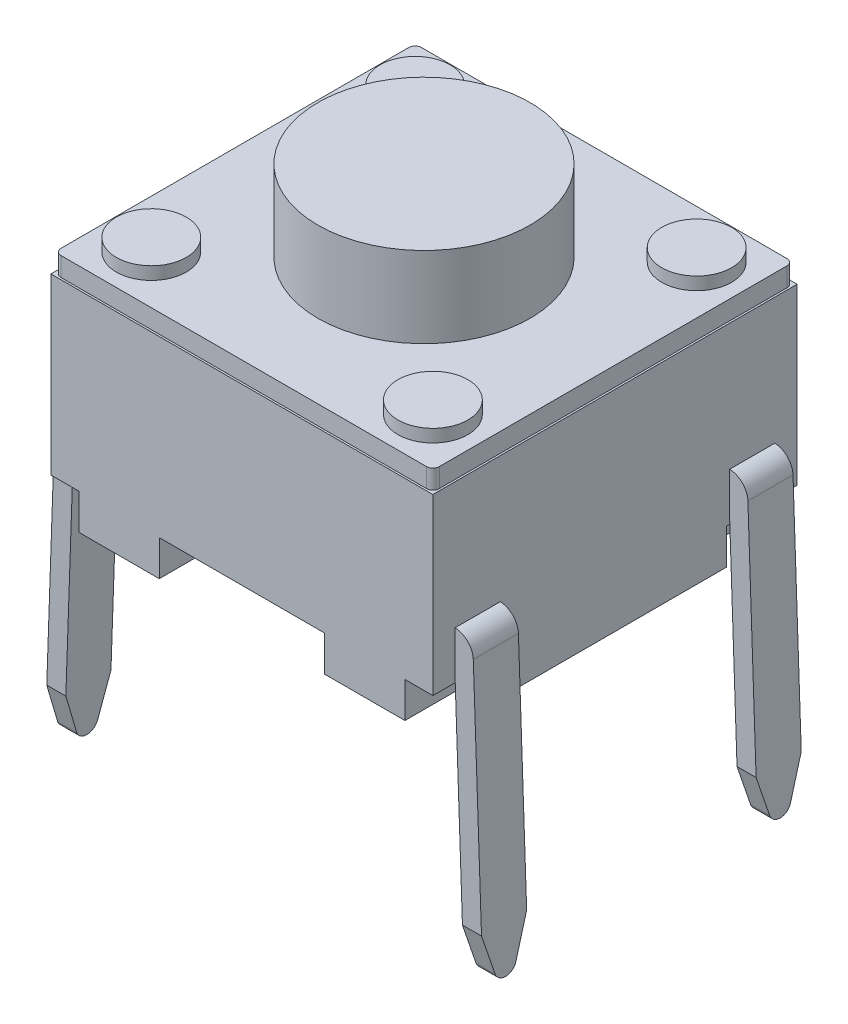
from build123d import *

# Parameters (mm, degrees)
ESQUISSE1_W                  = 6.01
ESQUISSE1_H                  = 5.03
EXTRUSION1_DEPTH             = 0.71
EXTRUSION2_DEPTH             = 0.71
CONG_1_R                     = 0.3
ENL_V_MAT_EXTRU_1_DEPTH      = 10.105035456
ENL_V_MAT_EXTRU_1_DEPTH_BACK = 10.105035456
EXTRUSION3_DEPTH             = 0.6
EXTRUSION4_DEPTH             = 2.865
EXTRUSION4_DEPTH_BACK        = 2.865
ESQUISSE7_W                  = 6.01
ESQUISSE7_H                  = 1.31
ESQUISSE9_W                  = 6.01
ESQUISSE9_H                  = 5.73
EXTRUSION6_DEPTH             = 3.3
ESQUISSE10_W                 = 2.6
ESQUISSE10_H                 = 0.56
ENL_V_MAT_EXTRU_2_DEPTH      = 10.509661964
ESQUISSE11_W                 = 1.14
ESQUISSE11_H                 = 1.12
ENL_V_MAT_EXTRU_3_DEPTH      = 0.56
ESQUISSE12_W                 = 0.44
ESQUISSE12_H                 = 1.11
ENL_V_MAT_EXTRU_4_DEPTH      = 0.56
ESQUISSE13_W                 = 5.95
ESQUISSE13_H                 = 5.67
EXTRUSION7_DEPTH             = 0.3
ESQUISSE14_R                 = 1.67
EXTRUSION8_DEPTH             = 1.27
ESQUISSE15_R                 = 0.55
EXTRUSION9_DEPTH             = 0.2
CONG_2_R                     = 0.1


with BuildPart() as part:
    # Esquisse1 → Extrusion1 (new body)
    with BuildSketch(Plane(origin=(0, 0, 0), x_dir=(1, 0, 0), z_dir=(0, 1, 0))):
        with Locations((3.005, 2.515)):
            Rectangle(ESQUISSE1_W, ESQUISSE1_H)
    extrude(amount=EXTRUSION1_DEPTH)

    # Esquisse3 → Extrusion2 (add)
    with BuildSketch(Plane.XY):
        Polygon((5.985206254, 0.71), (6.149683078, -4), (6.449865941, -4), (6.285389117, 0.71), align=None)
        Polygon((-0.139683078, -4), (-0.439865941, -4), (-0.275389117, 0.71), (0.024793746, 0.71), align=None)
    extrusion2 = extrude(amount=-EXTRUSION2_DEPTH)

    # Sym_trie1: Extrusion2 across plane
    add(extrusion2.mirror(Plane.XY.offset(-2.515)))

    # Cong_1
    cong_1_edges = [part.edges().sort_by_distance(p)[0] for p in [
        (6.285389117, 0.71, -0.355),
        (-0.275389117, 0.71, -0.355),
    ]]
    fillet(cong_1_edges, radius=CONG_1_R)

    # Esquisse5 → Enl_v. mat.-Extru.1 (cut, two sides: drawn at the far end of the back side and taken through both)
    with BuildSketch(Plane(origin=(0, 0, 0), x_dir=(0, 0, -1), z_dir=(1, 0, 0)).offset(-ENL_V_MAT_EXTRU_1_DEPTH_BACK)):
        with BuildLine():
            Line((0.714694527, -3.27), (0.516394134, -3.891715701))
            ThreePointArc((0.516394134, -3.891715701), (0.355, -4), (0.193605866, -3.891715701))
            Line((0.193605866, -3.891715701), (-0.004694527, -3.27))
            Line((-0.004694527, -3.27), (-0.420575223, -3.27))
            Line((-0.420575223, -3.27), (-0.420575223, -4.427126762))
            Line((-0.420575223, -4.427126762), (0.992315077, -4.427126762))
            Line((0.992315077, -4.427126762), (0.992315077, -3.27))
            Line((0.992315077, -3.27), (0.714694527, -3.27))
        make_face()
        with BuildLine():
            Line((4.037684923, -3.27), (4.315305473, -3.27))
            Line((4.315305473, -3.27), (4.513605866, -3.891715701))
            ThreePointArc((4.513605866, -3.891715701), (4.675, -4), (4.836394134, -3.891715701))
            Line((4.836394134, -3.891715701), (5.034694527, -3.27))
            Line((5.034694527, -3.27), (5.450575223, -3.27))
            Line((5.450575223, -3.27), (5.450575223, -4.427126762))
            Line((5.450575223, -4.427126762), (4.037684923, -4.427126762))
            Line((4.037684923, -4.427126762), (4.037684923, -3.27))
        make_face()
    extrude(amount=ENL_V_MAT_EXTRU_1_DEPTH + ENL_V_MAT_EXTRU_1_DEPTH_BACK, mode=Mode.SUBTRACT)

    # Esquisse6 → Extrusion3 (add)
    with BuildSketch(Plane.XZ):
        Polygon((0, -4.32), (0, -5.03), (6.01, -5.03), (6.01, -4.32), (6.01, -0.71), (6.01, 0), (0, 0), (0, -0.71), align=None)
    extrude(amount=EXTRUSION3_DEPTH)

    # Esquisse7 → Extrusion4 (add, two sides: drawn at the far end of the back side and taken through both)
    with BuildSketch(Plane(origin=(0, 0, -2.515), x_dir=(-1, 0, 0), z_dir=(0, 0, -1)).offset(-EXTRUSION4_DEPTH_BACK)):
        with Locations((-3.005, 0.055)):
            Rectangle(ESQUISSE7_W, ESQUISSE7_H)
    extrude(amount=EXTRUSION4_DEPTH + EXTRUSION4_DEPTH_BACK)

    # Esquisse9 → Extrusion6 (add)
    with BuildSketch(Plane(origin=(0, -0.6, 0), x_dir=(-1, 0, 0), z_dir=(0, 1, 0))):
        with Locations((-3.005, -2.515)):
            Rectangle(ESQUISSE9_W, ESQUISSE9_H)
    extrude(amount=EXTRUSION6_DEPTH)

    # Esquisse10 → Enl_v. mat.-Extru.2 (cut, through all)
    with BuildSketch(Plane(origin=(0, 0, -5.38), x_dir=(-1, 0, 0), z_dir=(0, 0, -1))):
        with Locations((-3.005, -0.32)):
            Rectangle(ESQUISSE10_W, ESQUISSE10_H)
    extrude(amount=-ENL_V_MAT_EXTRU_2_DEPTH, mode=Mode.SUBTRACT)

    # Esquisse11 → Enl_v. mat.-Extru.3 (cut)
    with BuildSketch(Plane.XZ.offset(0.6)):
        with Locations((1.135, -2.515)):
            Rectangle(ESQUISSE11_W, ESQUISSE11_H)
        with Locations((4.875, -2.515)):
            Rectangle(ESQUISSE11_W, ESQUISSE11_H)
    extrude(amount=-ENL_V_MAT_EXTRU_3_DEPTH, mode=Mode.SUBTRACT)

    # Esquisse12 → Enl_v. mat.-Extru.4 (cut)
    with BuildSketch(Plane.XZ.offset(0.6)):
        with Locations((5.79, -4.825)):
            Rectangle(ESQUISSE12_W, ESQUISSE12_H)
        with Locations((0.22, -4.825)):
            Rectangle(ESQUISSE12_W, ESQUISSE12_H)
        with Locations((0.22, -0.205)):
            Rectangle(ESQUISSE12_W, ESQUISSE12_H)
        with Locations((5.79, -0.205)):
            Rectangle(ESQUISSE12_W, ESQUISSE12_H)
    extrude(amount=-ENL_V_MAT_EXTRU_4_DEPTH, mode=Mode.SUBTRACT)

    # Esquisse13 → Extrusion7 (add)
    with BuildSketch(Plane(origin=(0, 2.7, 0), x_dir=(-1, 0, 0), z_dir=(0, 1, 0))):
        with Locations((-3.005, -2.515)):
            Rectangle(ESQUISSE13_W, ESQUISSE13_H)
    extrude(amount=EXTRUSION7_DEPTH)

    # Esquisse14 → Extrusion8 (add)
    with BuildSketch(Plane(origin=(0, 3, 0), x_dir=(-1, 0, 0), z_dir=(0, 1, 0))):
        with Locations(Location((-3.005, -2.515, 0), (0, 0, 90))):
            Circle(ESQUISSE14_R)
    extrude(amount=EXTRUSION8_DEPTH)

    # Esquisse15 → Extrusion9 (add)
    with BuildSketch(Plane(origin=(0, 3, 0), x_dir=(-1, 0, 0), z_dir=(0, 1, 0))):
        with Locations(Location((-0.79, -4.59, 0), (0, 0, 90))):
            Circle(ESQUISSE15_R)
        with Locations(Location((-0.79, -0.44, 0), (0, 0, 270))):
            Circle(ESQUISSE15_R)
        with Locations(Location((-5.22, -0.44, 0), (0, 0, 90))):
            Circle(ESQUISSE15_R)
        with Locations(Location((-5.22, -4.59, 0), (0, 0, 270))):
            Circle(ESQUISSE15_R)
    extrude(amount=EXTRUSION9_DEPTH)

    # Cong_2
    cong_2_edges = [part.edges().sort_by_distance(p)[0] for p in [
        (5.98, 2.85, -5.35),
        (0.03, 2.85, -5.35),
        (0.03, 2.85, 0.32),
        (5.98, 2.85, 0.32),
    ]]
    fillet(cong_2_edges, radius=CONG_2_R)


solid = part.part
